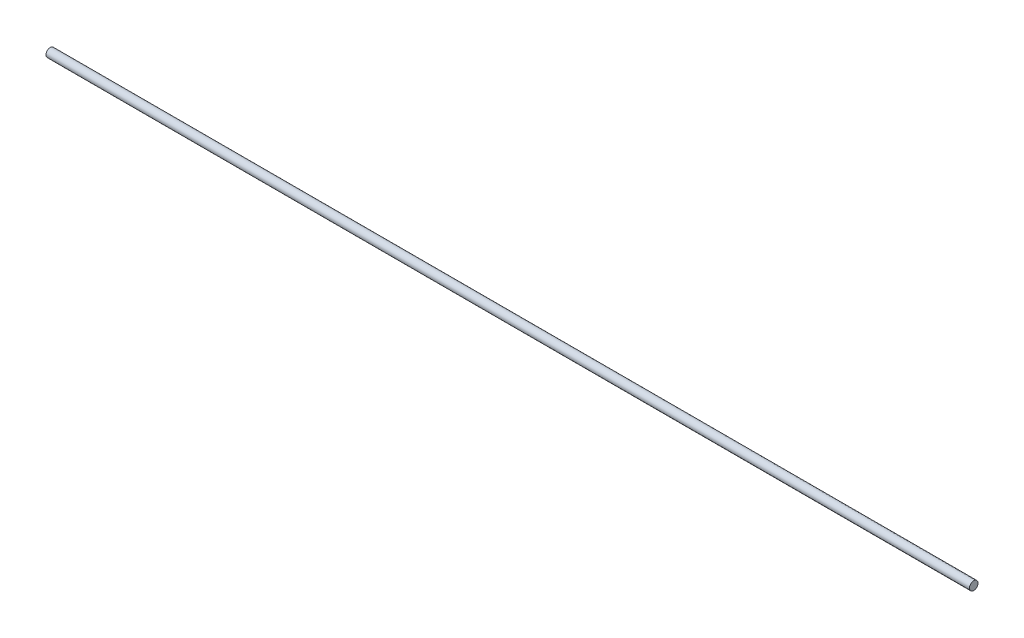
from build123d import *

# Parameters (mm, degrees)
ESQUISSE2_R      = 0.425
EXTRUSION1_DEPTH = 92


with BuildPart() as part:
    # Esquisse2 → Extrusion1 (new body)
    with BuildSketch(Plane(origin=(0, 0, 0), x_dir=(0, 0, -1), z_dir=(1, 0, 0))):
        Circle(ESQUISSE2_R)
    extrude(amount=EXTRUSION1_DEPTH)


solid = part.part
